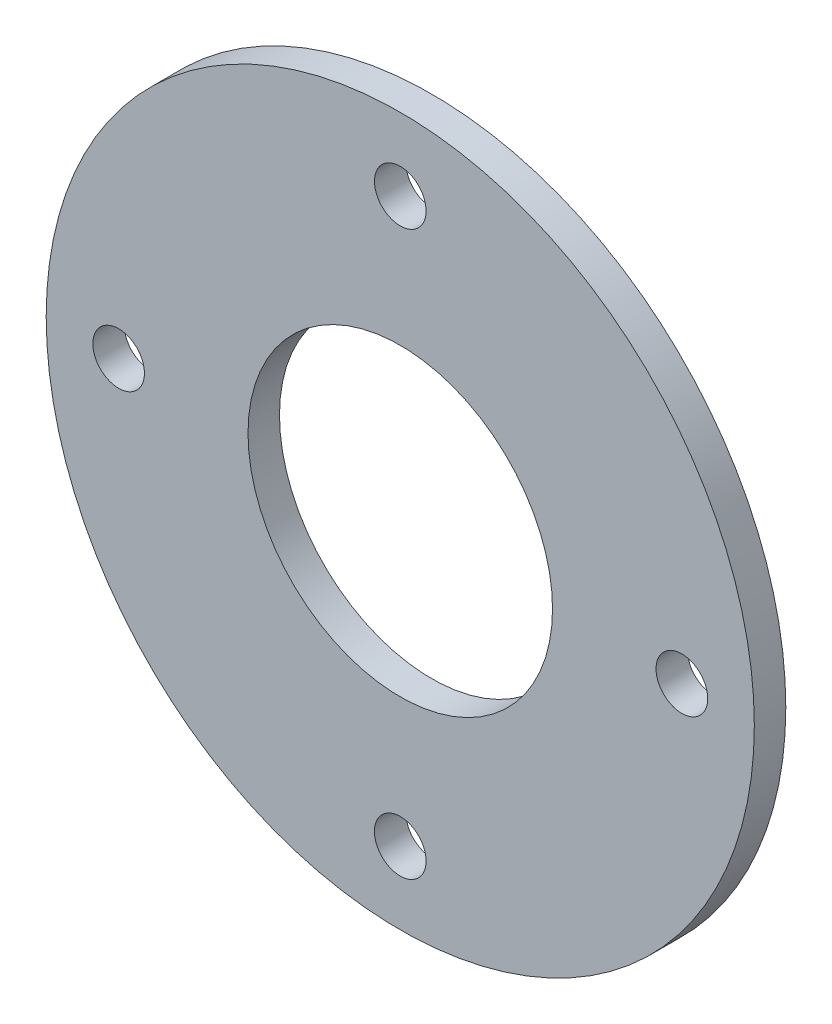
from build123d import *

# Parameters (mm, degrees)
SKETCH1_R               = 114.3
SKETCH1_R_2             = 49.149999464
EXTRUDE1_DEPTH          = 10.16
F_5_8_CLEARANCE_HOLE1_D = 16.66748


with BuildPart() as part:
    # Sketch1 → Extrude1 (new body)
    with BuildSketch(Plane.XY):
        Circle(SKETCH1_R)
        Circle(SKETCH1_R_2, mode=Mode.SUBTRACT)
    extrude(amount=EXTRUDE1_DEPTH)

    # 5_8 Clearance Hole1 (through all)
    with Locations(Plane(origin=(-61.229912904, -86.94526051, 0), x_dir=(-1, 0, 0), z_dir=(0, 0, -1))):
        with Locations((-61.229912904, 177.798020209), (29.681467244, 86.94526051), (-61.229912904, -3.966119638), (-152.141293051, 86.94526051)):
            Hole(F_5_8_CLEARANCE_HOLE1_D / 2)


solid = part.part
